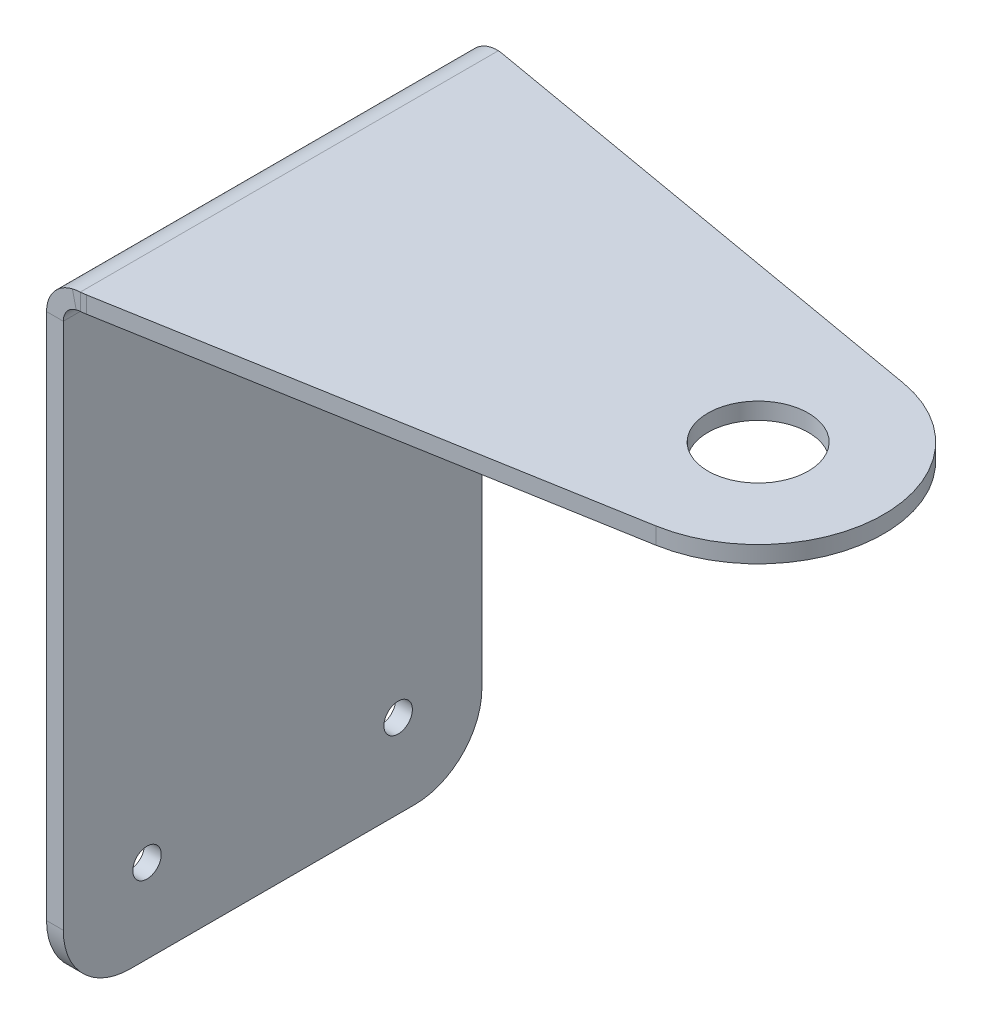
ISO-10303-21;
HEADER;
FILE_DESCRIPTION(('STEP AP214'),'2;1');
FILE_NAME('part.step','',(''),(''),'','','');
FILE_SCHEMA(('AUTOMOTIVE_DESIGN { 1 0 10303 214 1 1 1 1 }'));
ENDSEC;
DATA;
#1=APPLICATION_CONTEXT('core data for automotive mechanical design processes');
#2=APPLICATION_PROTOCOL_DEFINITION('international standard','automotive_design',2000,#1);
#3=PRODUCT_CONTEXT('',#1,'mechanical');
#4=PRODUCT('Part','Part','',(#3));
#5=PRODUCT_RELATED_PRODUCT_CATEGORY('part','',(#4));
#6=PRODUCT_DEFINITION_FORMATION('','',#4);
#7=PRODUCT_DEFINITION_CONTEXT('part definition',#1,'design');
#8=PRODUCT_DEFINITION('design','',#6,#7);
#9=PRODUCT_DEFINITION_SHAPE('','',#8);
#10=(LENGTH_UNIT() NAMED_UNIT(*) SI_UNIT(.MILLI.,.METRE.));
#11=(NAMED_UNIT(*) PLANE_ANGLE_UNIT() SI_UNIT($,.RADIAN.));
#12=(NAMED_UNIT(*) SI_UNIT($,.STERADIAN.) SOLID_ANGLE_UNIT());
#13=UNCERTAINTY_MEASURE_WITH_UNIT(LENGTH_MEASURE(1.E-05),#10,'distance_accuracy_value','');
#14=(GEOMETRIC_REPRESENTATION_CONTEXT(3) GLOBAL_UNCERTAINTY_ASSIGNED_CONTEXT((#13)) GLOBAL_UNIT_ASSIGNED_CONTEXT((#10,
#11,#12)) REPRESENTATION_CONTEXT('',''));
#15=CARTESIAN_POINT('',(0.,0.,0.));
#16=DIRECTION('',(0.,0.,1.));
#17=DIRECTION('',(1.,0.,0.));
#18=AXIS2_PLACEMENT_3D('',#15,#16,#17);
#19=CARTESIAN_POINT('',(0.,-2.,25.));
#20=DIRECTION('',(0.,1.,0.));
#21=DIRECTION('',(0.,0.,1.));
#22=AXIS2_PLACEMENT_3D('',#19,#20,#21);
#23=PLANE('',#22);
#24=CARTESIAN_POINT('',(60.,-2.,0.));
#25=DIRECTION('',(0.,1.,0.));
#26=DIRECTION('',(0.,0.,1.));
#27=AXIS2_PLACEMENT_3D('',#24,#25,#26);
#28=CIRCLE('',#27,6.);
#29=CARTESIAN_POINT('',(60.,-2.,6.));
#30=VERTEX_POINT('',#29);
#31=EDGE_CURVE('E535',#30,#30,#28,.T.);
#32=ORIENTED_EDGE('',*,*,#31,.T.);
#33=EDGE_LOOP('',(#32));
#34=FACE_BOUND('',#33,.T.);
#35=DIRECTION('',(0.,0.,-1.));
#36=VECTOR('',#35,1.);
#37=CARTESIAN_POINT('',(4.,-2.,25.));
#38=LINE('',#37,#36);
#39=CARTESIAN_POINT('',(4.,-2.,24.9699405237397));
#40=VERTEX_POINT('',#39);
#41=CARTESIAN_POINT('',(4.,-2.,-24.9699405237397));
#42=VERTEX_POINT('',#41);
#43=EDGE_CURVE('E61',#40,#42,#38,.T.);
#44=ORIENTED_EDGE('',*,*,#43,.T.);
#45=CARTESIAN_POINT('',(3.3071450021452,-2.,-17.));
#46=DIRECTION('',(0.,1.,0.));
#47=DIRECTION('',(-1.,0.,0.));
#48=AXIS2_PLACEMENT_3D('',#45,#46,#47);
#49=CIRCLE('',#48,8.);
#50=CARTESIAN_POINT('',(4.68253851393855,-2.,-24.8808814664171));
#51=VERTEX_POINT('',#50);
#52=EDGE_CURVE('E76',#42,#51,#49,.F.);
#53=ORIENTED_EDGE('',*,*,#52,.T.);
#54=DIRECTION('',(0.985110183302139,0.,0.171924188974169));
#55=VECTOR('',#54,1.);
#56=CARTESIAN_POINT('',(4.,-2.00000000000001,-25.));
#57=LINE('',#56,#55);
#58=CARTESIAN_POINT('',(62.5788628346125,-2.00000000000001,-14.7766527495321));
#59=VERTEX_POINT('',#58);
#60=EDGE_CURVE('E390',#51,#59,#57,.T.);
#61=ORIENTED_EDGE('',*,*,#60,.T.);
#62=CARTESIAN_POINT('',(60.,-2.00000000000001,0.));
#63=DIRECTION('',(0.,1.,0.));
#64=DIRECTION('',(0.,0.,1.));
#65=AXIS2_PLACEMENT_3D('',#62,#63,#64);
#66=CIRCLE('',#65,15.);
#67=CARTESIAN_POINT('',(62.5788628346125,-2.,14.7766527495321));
#68=VERTEX_POINT('',#67);
#69=EDGE_CURVE('E378',#59,#68,#66,.F.);
#70=ORIENTED_EDGE('',*,*,#69,.T.);
#71=DIRECTION('',(-0.985110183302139,0.,0.171924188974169));
#72=VECTOR('',#71,1.);
#73=CARTESIAN_POINT('',(62.5788628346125,-2.00000000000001,14.7766527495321));
#74=LINE('',#73,#72);
#75=CARTESIAN_POINT('',(4.68253851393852,-2.00000000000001,24.8808814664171));
#76=VERTEX_POINT('',#75);
#77=EDGE_CURVE('E376',#68,#76,#74,.T.);
#78=ORIENTED_EDGE('',*,*,#77,.T.);
#79=CARTESIAN_POINT('',(3.30714500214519,-2.,17.));
#80=DIRECTION('',(0.,1.,0.));
#81=DIRECTION('',(-1.,0.,0.));
#82=AXIS2_PLACEMENT_3D('',#79,#80,#81);
#83=CIRCLE('',#82,8.);
#84=EDGE_CURVE('E68',#76,#40,#83,.F.);
#85=ORIENTED_EDGE('',*,*,#84,.T.);
#86=EDGE_LOOP('',(#44,#53,#61,#70,#78,#85));
#87=FACE_BOUND('',#86,.T.);
#88=ADVANCED_FACE('F50',(#34,#87),#23,.F.);
#89=CARTESIAN_POINT('',(0.,0.,25.));
#90=DIRECTION('',(0.,1.,0.));
#91=DIRECTION('',(0.,0.,1.));
#92=AXIS2_PLACEMENT_3D('',#89,#90,#91);
#93=PLANE('',#92);
#94=CARTESIAN_POINT('',(60.,0.,0.));
#95=DIRECTION('',(0.,1.,0.));
#96=DIRECTION('',(0.,0.,1.));
#97=AXIS2_PLACEMENT_3D('',#94,#95,#96);
#98=CIRCLE('',#97,6.);
#99=CARTESIAN_POINT('',(60.,0.,6.));
#100=VERTEX_POINT('',#99);
#101=EDGE_CURVE('E532',#100,#100,#98,.T.);
#102=ORIENTED_EDGE('',*,*,#101,.F.);
#103=EDGE_LOOP('',(#102));
#104=FACE_BOUND('',#103,.T.);
#105=DIRECTION('',(0.985110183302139,0.,0.171924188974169));
#106=VECTOR('',#105,1.);
#107=CARTESIAN_POINT('',(4.,0.,-25.));
#108=LINE('',#107,#106);
#109=CARTESIAN_POINT('',(4.68253851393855,0.,-24.8808814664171));
#110=VERTEX_POINT('',#109);
#111=CARTESIAN_POINT('',(62.5788628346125,0.,-14.7766527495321));
#112=VERTEX_POINT('',#111);
#113=EDGE_CURVE('E170',#110,#112,#108,.T.);
#114=ORIENTED_EDGE('',*,*,#113,.F.);
#115=CARTESIAN_POINT('',(3.3071450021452,0.,-17.));
#116=DIRECTION('',(0.,1.,0.));
#117=DIRECTION('',(-1.,0.,0.));
#118=AXIS2_PLACEMENT_3D('',#115,#116,#117);
#119=CIRCLE('',#118,8.);
#120=CARTESIAN_POINT('',(4.,0.,-24.9699405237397));
#121=VERTEX_POINT('',#120);
#122=EDGE_CURVE('E155',#110,#121,#119,.T.);
#123=ORIENTED_EDGE('',*,*,#122,.T.);
#124=DIRECTION('',(0.,0.,-1.));
#125=VECTOR('',#124,1.);
#126=CARTESIAN_POINT('',(4.,0.,25.));
#127=LINE('',#126,#125);
#128=CARTESIAN_POINT('',(4.,0.,24.9699405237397));
#129=VERTEX_POINT('',#128);
#130=EDGE_CURVE('E162',#129,#121,#127,.T.);
#131=ORIENTED_EDGE('',*,*,#130,.F.);
#132=CARTESIAN_POINT('',(3.30714500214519,0.,17.));
#133=DIRECTION('',(0.,1.,0.));
#134=DIRECTION('',(-1.,0.,0.));
#135=AXIS2_PLACEMENT_3D('',#132,#133,#134);
#136=CIRCLE('',#135,8.);
#137=CARTESIAN_POINT('',(4.68253851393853,0.,24.8808814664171));
#138=VERTEX_POINT('',#137);
#139=EDGE_CURVE('E171',#129,#138,#136,.T.);
#140=ORIENTED_EDGE('',*,*,#139,.T.);
#141=DIRECTION('',(-0.985110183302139,0.,0.171924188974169));
#142=VECTOR('',#141,1.);
#143=CARTESIAN_POINT('',(62.5788628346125,0.,14.7766527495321));
#144=LINE('',#143,#142);
#145=CARTESIAN_POINT('',(62.5788628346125,0.,14.7766527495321));
#146=VERTEX_POINT('',#145);
#147=EDGE_CURVE('E371',#146,#138,#144,.T.);
#148=ORIENTED_EDGE('',*,*,#147,.F.);
#149=CARTESIAN_POINT('',(60.,0.,0.));
#150=DIRECTION('',(0.,1.,0.));
#151=DIRECTION('',(0.,0.,1.));
#152=AXIS2_PLACEMENT_3D('',#149,#150,#151);
#153=CIRCLE('',#152,15.);
#154=EDGE_CURVE('E388',#112,#146,#153,.F.);
#155=ORIENTED_EDGE('',*,*,#154,.F.);
#156=EDGE_LOOP('',(#114,#123,#131,#140,#148,#155));
#157=FACE_BOUND('',#156,.T.);
#158=ADVANCED_FACE('F167',(#104,#157),#93,.T.);
#159=CARTESIAN_POINT('',(4.,-2.00000000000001,-25.));
#160=DIRECTION('',(-0.171924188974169,0.,0.985110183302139));
#161=DIRECTION('',(0.985110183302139,0.,0.171924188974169));
#162=AXIS2_PLACEMENT_3D('',#159,#160,#161);
#163=PLANE('',#162);
#164=ORIENTED_EDGE('',*,*,#60,.F.);
#165=DIRECTION('',(0.,1.,0.));
#166=VECTOR('',#165,1.);
#167=CARTESIAN_POINT('',(4.68253851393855,-2.,-24.8808814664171));
#168=LINE('',#167,#166);
#169=EDGE_CURVE('E360',#51,#110,#168,.T.);
#170=ORIENTED_EDGE('',*,*,#169,.T.);
#171=ORIENTED_EDGE('',*,*,#113,.T.);
#172=DIRECTION('',(0.,-1.,0.));
#173=VECTOR('',#172,1.);
#174=CARTESIAN_POINT('',(62.5788628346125,-2.00000000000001,-14.7766527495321));
#175=LINE('',#174,#173);
#176=EDGE_CURVE('E387',#59,#112,#175,.F.);
#177=ORIENTED_EDGE('',*,*,#176,.F.);
#178=EDGE_LOOP('',(#164,#170,#171,#177));
#179=FACE_BOUND('',#178,.T.);
#180=ADVANCED_FACE('F397',(#179),#163,.F.);
#181=CARTESIAN_POINT('',(60.,-2.00000000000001,0.));
#182=DIRECTION('',(0.,1.,0.));
#183=DIRECTION('',(0.,0.,1.));
#184=AXIS2_PLACEMENT_3D('',#181,#182,#183);
#185=CYLINDRICAL_SURFACE('',#184,15.);
#186=ORIENTED_EDGE('',*,*,#69,.F.);
#187=ORIENTED_EDGE('',*,*,#176,.T.);
#188=ORIENTED_EDGE('',*,*,#154,.T.);
#189=DIRECTION('',(0.,-1.,0.));
#190=VECTOR('',#189,1.);
#191=CARTESIAN_POINT('',(62.5788628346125,-2.,14.7766527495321));
#192=LINE('',#191,#190);
#193=EDGE_CURVE('E375',#68,#146,#192,.F.);
#194=ORIENTED_EDGE('',*,*,#193,.F.);
#195=EDGE_LOOP('',(#186,#187,#188,#194));
#196=FACE_BOUND('',#195,.T.);
#197=ADVANCED_FACE('F398',(#196),#185,.T.);
#198=CARTESIAN_POINT('',(62.5788628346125,-2.00000000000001,14.7766527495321));
#199=DIRECTION('',(-0.171924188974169,0.,-0.985110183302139));
#200=DIRECTION('',(-0.985110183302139,0.,0.171924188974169));
#201=AXIS2_PLACEMENT_3D('',#198,#199,#200);
#202=PLANE('',#201);
#203=ORIENTED_EDGE('',*,*,#147,.T.);
#204=DIRECTION('',(0.,-1.,0.));
#205=VECTOR('',#204,1.);
#206=CARTESIAN_POINT('',(4.68253851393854,-2.00000000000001,24.8808814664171));
#207=LINE('',#206,#205);
#208=EDGE_CURVE('E185',#138,#76,#207,.T.);
#209=ORIENTED_EDGE('',*,*,#208,.T.);
#210=ORIENTED_EDGE('',*,*,#77,.F.);
#211=ORIENTED_EDGE('',*,*,#193,.T.);
#212=EDGE_LOOP('',(#203,#209,#210,#211));
#213=FACE_BOUND('',#212,.T.);
#214=ADVANCED_FACE('F373',(#213),#202,.F.);
#215=CARTESIAN_POINT('',(3.3071450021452,-2.,-17.));
#216=DIRECTION('',(0.,-1.,0.));
#217=DIRECTION('',(1.,0.,0.));
#218=AXIS2_PLACEMENT_3D('',#215,#216,#217);
#219=CYLINDRICAL_SURFACE('',#218,8.);
#220=CARTESIAN_POINT('',(4.,0.,-24.9699405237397));
#221=CARTESIAN_POINT('',(4.,-2.,-24.9699405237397));
#222=B_SPLINE_CURVE_WITH_KNOTS('',1,(#220,#221),.UNSPECIFIED.,.F.,.F.,(2,2),(0.,1.),.UNSPECIFIED.);
#223=EDGE_CURVE('E152',#121,#42,#222,.T.);
#224=ORIENTED_EDGE('',*,*,#223,.F.);
#225=ORIENTED_EDGE('',*,*,#122,.F.);
#226=ORIENTED_EDGE('',*,*,#169,.F.);
#227=ORIENTED_EDGE('',*,*,#52,.F.);
#228=EDGE_LOOP('',(#224,#225,#226,#227));
#229=FACE_BOUND('',#228,.T.);
#230=ADVANCED_FACE('F154',(#229),#219,.T.);
#231=CARTESIAN_POINT('',(3.30714500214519,-2.00000000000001,17.));
#232=DIRECTION('',(0.,1.,0.));
#233=DIRECTION('',(-1.,0.,0.));
#234=AXIS2_PLACEMENT_3D('',#231,#232,#233);
#235=CYLINDRICAL_SURFACE('',#234,8.);
#236=CARTESIAN_POINT('',(4.,-2.,24.9699405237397));
#237=CARTESIAN_POINT('',(4.,0.,24.9699405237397));
#238=B_SPLINE_CURVE_WITH_KNOTS('',1,(#236,#237),.UNSPECIFIED.,.F.,.F.,(2,2),(0.,1.),.UNSPECIFIED.);
#239=EDGE_CURVE('E12',#40,#129,#238,.T.);
#240=ORIENTED_EDGE('',*,*,#239,.F.);
#241=ORIENTED_EDGE('',*,*,#84,.F.);
#242=ORIENTED_EDGE('',*,*,#208,.F.);
#243=ORIENTED_EDGE('',*,*,#139,.F.);
#244=EDGE_LOOP('',(#240,#241,#242,#243));
#245=FACE_BOUND('',#244,.T.);
#246=ADVANCED_FACE('F52',(#245),#235,.T.);
#247=CARTESIAN_POINT('',(4.,-67.,-17.));
#248=DIRECTION('',(-1.,0.,0.));
#249=DIRECTION('',(0.,0.,1.));
#250=AXIS2_PLACEMENT_3D('',#247,#248,#249);
#251=CYLINDRICAL_SURFACE('',#250,8.);
#252=CARTESIAN_POINT('',(2.,-67.,-17.));
#253=DIRECTION('',(-1.,0.,0.));
#254=DIRECTION('',(0.,0.,1.));
#255=AXIS2_PLACEMENT_3D('',#252,#253,#254);
#256=CIRCLE('',#255,8.);
#257=CARTESIAN_POINT('',(2.,-75.,-17.));
#258=VERTEX_POINT('',#257);
#259=CARTESIAN_POINT('',(2.,-67.,-25.));
#260=VERTEX_POINT('',#259);
#261=EDGE_CURVE('E475',#258,#260,#256,.F.);
#262=ORIENTED_EDGE('',*,*,#261,.F.);
#263=DIRECTION('',(-1.,0.,0.));
#264=VECTOR('',#263,1.);
#265=CARTESIAN_POINT('',(2.,-75.,-17.));
#266=LINE('',#265,#264);
#267=CARTESIAN_POINT('',(0.,-75.,-17.));
#268=VERTEX_POINT('',#267);
#269=EDGE_CURVE('E497',#268,#258,#266,.F.);
#270=ORIENTED_EDGE('',*,*,#269,.F.);
#271=CARTESIAN_POINT('',(0.,-67.,-17.));
#272=DIRECTION('',(-1.,0.,0.));
#273=DIRECTION('',(0.,0.,1.));
#274=AXIS2_PLACEMENT_3D('',#271,#272,#273);
#275=CIRCLE('',#274,8.);
#276=CARTESIAN_POINT('',(0.,-67.,-25.));
#277=VERTEX_POINT('',#276);
#278=EDGE_CURVE('E493',#277,#268,#275,.T.);
#279=ORIENTED_EDGE('',*,*,#278,.F.);
#280=DIRECTION('',(-1.,0.,0.));
#281=VECTOR('',#280,1.);
#282=CARTESIAN_POINT('',(4.,-67.,-25.));
#283=LINE('',#282,#281);
#284=EDGE_CURVE('E490',#260,#277,#283,.T.);
#285=ORIENTED_EDGE('',*,*,#284,.F.);
#286=EDGE_LOOP('',(#262,#270,#279,#285));
#287=FACE_BOUND('',#286,.T.);
#288=ADVANCED_FACE('F421',(#287),#251,.T.);
#289=CARTESIAN_POINT('',(2.,-67.,17.));
#290=DIRECTION('',(-1.,0.,0.));
#291=DIRECTION('',(0.,0.,1.));
#292=AXIS2_PLACEMENT_3D('',#289,#290,#291);
#293=CYLINDRICAL_SURFACE('',#292,8.);
#294=CARTESIAN_POINT('',(2.,-67.,17.));
#295=DIRECTION('',(-1.,0.,0.));
#296=DIRECTION('',(0.,0.,1.));
#297=AXIS2_PLACEMENT_3D('',#294,#295,#296);
#298=CIRCLE('',#297,8.);
#299=CARTESIAN_POINT('',(2.,-67.,25.));
#300=VERTEX_POINT('',#299);
#301=CARTESIAN_POINT('',(2.,-75.,17.));
#302=VERTEX_POINT('',#301);
#303=EDGE_CURVE('E469',#300,#302,#298,.F.);
#304=ORIENTED_EDGE('',*,*,#303,.F.);
#305=DIRECTION('',(-1.,0.,0.));
#306=VECTOR('',#305,1.);
#307=CARTESIAN_POINT('',(4.,-67.,25.));
#308=LINE('',#307,#306);
#309=CARTESIAN_POINT('',(0.,-67.,25.));
#310=VERTEX_POINT('',#309);
#311=EDGE_CURVE('E459',#310,#300,#308,.F.);
#312=ORIENTED_EDGE('',*,*,#311,.F.);
#313=CARTESIAN_POINT('',(0.,-67.,17.));
#314=DIRECTION('',(-1.,0.,0.));
#315=DIRECTION('',(0.,0.,1.));
#316=AXIS2_PLACEMENT_3D('',#313,#314,#315);
#317=CIRCLE('',#316,8.);
#318=CARTESIAN_POINT('',(0.,-75.,17.));
#319=VERTEX_POINT('',#318);
#320=EDGE_CURVE('E464',#319,#310,#317,.T.);
#321=ORIENTED_EDGE('',*,*,#320,.F.);
#322=DIRECTION('',(-1.,0.,0.));
#323=VECTOR('',#322,1.);
#324=CARTESIAN_POINT('',(2.,-75.,17.));
#325=LINE('',#324,#323);
#326=EDGE_CURVE('E501',#302,#319,#325,.T.);
#327=ORIENTED_EDGE('',*,*,#326,.F.);
#328=EDGE_LOOP('',(#304,#312,#321,#327));
#329=FACE_BOUND('',#328,.T.);
#330=ADVANCED_FACE('F425',(#329),#293,.T.);
#331=CARTESIAN_POINT('',(2.,-75.,25.));
#332=DIRECTION('',(0.,-1.,0.));
#333=DIRECTION('',(0.,0.,-1.));
#334=AXIS2_PLACEMENT_3D('',#331,#332,#333);
#335=PLANE('',#334);
#336=DIRECTION('',(0.,0.,-1.));
#337=VECTOR('',#336,1.);
#338=CARTESIAN_POINT('',(2.,-75.,25.));
#339=LINE('',#338,#337);
#340=EDGE_CURVE('E480',#302,#258,#339,.T.);
#341=ORIENTED_EDGE('',*,*,#340,.F.);
#342=ORIENTED_EDGE('',*,*,#326,.T.);
#343=DIRECTION('',(0.,0.,-1.));
#344=VECTOR('',#343,1.);
#345=CARTESIAN_POINT('',(0.,-75.,25.));
#346=LINE('',#345,#344);
#347=EDGE_CURVE('E499',#319,#268,#346,.T.);
#348=ORIENTED_EDGE('',*,*,#347,.T.);
#349=ORIENTED_EDGE('',*,*,#269,.T.);
#350=EDGE_LOOP('',(#341,#342,#348,#349));
#351=FACE_BOUND('',#350,.T.);
#352=ADVANCED_FACE('F430',(#351),#335,.T.);
#353=CARTESIAN_POINT('',(0.,-75.,25.));
#354=DIRECTION('',(-1.,0.,0.));
#355=DIRECTION('',(0.,0.,1.));
#356=AXIS2_PLACEMENT_3D('',#353,#354,#355);
#357=PLANE('',#356);
#358=CARTESIAN_POINT('',(0.,-65.,15.));
#359=DIRECTION('',(-1.,0.,0.));
#360=DIRECTION('',(0.,0.,1.));
#361=AXIS2_PLACEMENT_3D('',#358,#359,#360);
#362=CIRCLE('',#361,1.69999999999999);
#363=CARTESIAN_POINT('',(0.,-65.,16.7));
#364=VERTEX_POINT('',#363);
#365=EDGE_CURVE('E543',#364,#364,#362,.T.);
#366=ORIENTED_EDGE('',*,*,#365,.F.);
#367=EDGE_LOOP('',(#366));
#368=FACE_BOUND('',#367,.T.);
#369=CARTESIAN_POINT('',(0.,-65.,-15.));
#370=DIRECTION('',(-1.,0.,0.));
#371=DIRECTION('',(0.,0.,1.));
#372=AXIS2_PLACEMENT_3D('',#369,#370,#371);
#373=CIRCLE('',#372,1.69999999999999);
#374=CARTESIAN_POINT('',(0.,-65.,-13.3));
#375=VERTEX_POINT('',#374);
#376=EDGE_CURVE('E536',#375,#375,#373,.T.);
#377=ORIENTED_EDGE('',*,*,#376,.F.);
#378=EDGE_LOOP('',(#377));
#379=FACE_BOUND('',#378,.T.);
#380=ORIENTED_EDGE('',*,*,#347,.F.);
#381=ORIENTED_EDGE('',*,*,#320,.T.);
#382=DIRECTION('',(0.,1.,0.));
#383=VECTOR('',#382,1.);
#384=CARTESIAN_POINT('',(0.,-75.,25.));
#385=LINE('',#384,#383);
#386=CARTESIAN_POINT('',(0.,-4.,25.));
#387=VERTEX_POINT('',#386);
#388=EDGE_CURVE('E457',#310,#387,#385,.T.);
#389=ORIENTED_EDGE('',*,*,#388,.T.);
#390=DIRECTION('',(0.,0.,-1.));
#391=VECTOR('',#390,1.);
#392=CARTESIAN_POINT('',(0.,-4.,25.));
#393=LINE('',#392,#391);
#394=CARTESIAN_POINT('',(0.,-4.,-25.));
#395=VERTEX_POINT('',#394);
#396=EDGE_CURVE('E463',#387,#395,#393,.T.);
#397=ORIENTED_EDGE('',*,*,#396,.T.);
#398=DIRECTION('',(0.,1.,0.));
#399=VECTOR('',#398,1.);
#400=CARTESIAN_POINT('',(0.,-75.,-25.));
#401=LINE('',#400,#399);
#402=EDGE_CURVE('E487',#277,#395,#401,.T.);
#403=ORIENTED_EDGE('',*,*,#402,.F.);
#404=ORIENTED_EDGE('',*,*,#278,.T.);
#405=EDGE_LOOP('',(#380,#381,#389,#397,#403,#404));
#406=FACE_BOUND('',#405,.T.);
#407=ADVANCED_FACE('F437',(#368,#379,#406),#357,.T.);
#408=CARTESIAN_POINT('',(4.,-2.,-25.));
#409=DIRECTION('',(0.,0.,-1.));
#410=DIRECTION('',(-1.,0.,0.));
#411=AXIS2_PLACEMENT_3D('',#408,#409,#410);
#412=PLANE('',#411);
#413=DIRECTION('',(0.,1.,0.));
#414=VECTOR('',#413,1.);
#415=CARTESIAN_POINT('',(2.,-75.,-25.));
#416=LINE('',#415,#414);
#417=CARTESIAN_POINT('',(2.,-4.,-25.));
#418=VERTEX_POINT('',#417);
#419=EDGE_CURVE('E471',#260,#418,#416,.T.);
#420=ORIENTED_EDGE('',*,*,#419,.F.);
#421=ORIENTED_EDGE('',*,*,#284,.T.);
#422=ORIENTED_EDGE('',*,*,#402,.T.);
#423=DIRECTION('',(1.,0.,0.));
#424=VECTOR('',#423,1.);
#425=CARTESIAN_POINT('',(0.,-4.,-25.));
#426=LINE('',#425,#424);
#427=EDGE_CURVE('E484',#395,#418,#426,.T.);
#428=ORIENTED_EDGE('',*,*,#427,.T.);
#429=EDGE_LOOP('',(#420,#421,#422,#428));
#430=FACE_BOUND('',#429,.T.);
#431=ADVANCED_FACE('F441',(#430),#412,.T.);
#432=CARTESIAN_POINT('',(2.,-75.,25.));
#433=DIRECTION('',(-1.,0.,0.));
#434=DIRECTION('',(0.,0.,1.));
#435=AXIS2_PLACEMENT_3D('',#432,#433,#434);
#436=PLANE('',#435);
#437=CARTESIAN_POINT('',(2.,-65.,15.));
#438=DIRECTION('',(1.,0.,0.));
#439=DIRECTION('',(0.,0.,-1.));
#440=AXIS2_PLACEMENT_3D('',#437,#438,#439);
#441=CIRCLE('',#440,1.69999999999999);
#442=CARTESIAN_POINT('',(2.,-65.,13.3));
#443=VERTEX_POINT('',#442);
#444=EDGE_CURVE('E546',#443,#443,#441,.T.);
#445=ORIENTED_EDGE('',*,*,#444,.F.);
#446=EDGE_LOOP('',(#445));
#447=FACE_BOUND('',#446,.T.);
#448=CARTESIAN_POINT('',(2.,-65.,-15.));
#449=DIRECTION('',(1.,0.,0.));
#450=DIRECTION('',(0.,0.,-1.));
#451=AXIS2_PLACEMENT_3D('',#448,#449,#450);
#452=CIRCLE('',#451,1.69999999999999);
#453=CARTESIAN_POINT('',(2.,-65.,-16.7));
#454=VERTEX_POINT('',#453);
#455=EDGE_CURVE('E540',#454,#454,#452,.T.);
#456=ORIENTED_EDGE('',*,*,#455,.F.);
#457=EDGE_LOOP('',(#456));
#458=FACE_BOUND('',#457,.T.);
#459=DIRECTION('',(0.,1.,0.));
#460=VECTOR('',#459,1.);
#461=CARTESIAN_POINT('',(2.,-75.,25.));
#462=LINE('',#461,#460);
#463=CARTESIAN_POINT('',(2.,-4.,25.));
#464=VERTEX_POINT('',#463);
#465=EDGE_CURVE('E470',#300,#464,#462,.T.);
#466=ORIENTED_EDGE('',*,*,#465,.F.);
#467=ORIENTED_EDGE('',*,*,#303,.T.);
#468=ORIENTED_EDGE('',*,*,#340,.T.);
#469=ORIENTED_EDGE('',*,*,#261,.T.);
#470=ORIENTED_EDGE('',*,*,#419,.T.);
#471=DIRECTION('',(0.,0.,-1.));
#472=VECTOR('',#471,1.);
#473=CARTESIAN_POINT('',(2.,-4.,25.));
#474=LINE('',#473,#472);
#475=EDGE_CURVE('E383',#464,#418,#474,.T.);
#476=ORIENTED_EDGE('',*,*,#475,.F.);
#477=EDGE_LOOP('',(#466,#467,#468,#469,#470,#476));
#478=FACE_BOUND('',#477,.T.);
#479=ADVANCED_FACE('F445',(#447,#458,#478),#436,.F.);
#480=CARTESIAN_POINT('',(4.,-4.,25.));
#481=DIRECTION('',(0.,0.,1.));
#482=DIRECTION('',(1.,0.,0.));
#483=AXIS2_PLACEMENT_3D('',#480,#481,#482);
#484=PLANE('',#483);
#485=ORIENTED_EDGE('',*,*,#388,.F.);
#486=ORIENTED_EDGE('',*,*,#311,.T.);
#487=ORIENTED_EDGE('',*,*,#465,.T.);
#488=DIRECTION('',(-1.,0.,0.));
#489=VECTOR('',#488,1.);
#490=CARTESIAN_POINT('',(2.,-4.,25.));
#491=LINE('',#490,#489);
#492=EDGE_CURVE('E380',#464,#387,#491,.T.);
#493=ORIENTED_EDGE('',*,*,#492,.T.);
#494=EDGE_LOOP('',(#485,#486,#487,#493));
#495=FACE_BOUND('',#494,.T.);
#496=ADVANCED_FACE('F217',(#495),#484,.T.);
#497=CARTESIAN_POINT('',(4.,0.,-24.9699405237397));
#498=CARTESIAN_POINT('',(3.69203962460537,0.,-24.9799611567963));
#499=CARTESIAN_POINT('',(3.38416761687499,-0.0357106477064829,-24.9899793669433));
#500=CARTESIAN_POINT('',(3.08438389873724,-0.106204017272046,-25.));
#501=CARTESIAN_POINT('',(4.,-2.,-24.9699405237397));
#502=CARTESIAN_POINT('',(3.84601984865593,-2.,-24.9799611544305));
#503=CARTESIAN_POINT('',(3.69208377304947,-2.01785533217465,-24.9899793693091));
#504=CARTESIAN_POINT('',(3.54219194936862,-2.05310200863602,-25.));
#505=B_SPLINE_SURFACE_WITH_KNOTS('',1,3,((#497,#498,#499,#500),(#501,#502,#503,#504)),
.UNSPECIFIED.,.F.,.F.,.F.,(2,2),(4,4),(0.,1.),(0.,1.),.UNSPECIFIED.);
#506=CARTESIAN_POINT('',(4.,-2.,-24.9699405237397));
#507=CARTESIAN_POINT('',(3.84601984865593,-2.,-24.9799611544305));
#508=CARTESIAN_POINT('',(3.69208377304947,-2.01785533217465,-24.9899793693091));
#509=CARTESIAN_POINT('',(3.54219194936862,-2.05310200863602,-25.));
#510=B_SPLINE_CURVE_WITH_KNOTS('',3,(#506,#507,#508,#509),.UNSPECIFIED.,.F.,.F.,(4,4),(0.,1.),.UNSPECIFIED.);
#511=CARTESIAN_POINT('',(3.54219194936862,-2.05310200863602,-25.));
#512=VERTEX_POINT('',#511);
#513=EDGE_CURVE('E339',#42,#512,#510,.T.);
#514=CARTESIAN_POINT('',(3.54219194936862,-2.05310200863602,-25.));
#515=CARTESIAN_POINT('',(3.08438389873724,-0.106204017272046,-25.));
#516=B_SPLINE_CURVE_WITH_KNOTS('',1,(#514,#515),.UNSPECIFIED.,.F.,.F.,(2,2),(0.,1.),.UNSPECIFIED.);
#517=CARTESIAN_POINT('',(3.08438389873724,-0.106204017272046,-25.));
#518=VERTEX_POINT('',#517);
#519=EDGE_CURVE('E189',#512,#518,#516,.T.);
#520=CARTESIAN_POINT('',(3.08438389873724,-0.106204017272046,-25.));
#521=CARTESIAN_POINT('',(3.38416761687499,-0.0357106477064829,-24.9899793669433));
#522=CARTESIAN_POINT('',(3.69203962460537,0.,-24.9799611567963));
#523=CARTESIAN_POINT('',(4.,0.,-24.9699405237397));
#524=B_SPLINE_CURVE_WITH_KNOTS('',3,(#520,#521,#522,#523),.UNSPECIFIED.,.F.,.F.,(4,4),(0.,1.),.UNSPECIFIED.);
#525=EDGE_CURVE('E179',#121,#518,#524,.F.);
#526=ORIENTED_EDGE('',*,*,#223,.T.);
#527=ORIENTED_EDGE('',*,*,#513,.T.);
#528=ORIENTED_EDGE('',*,*,#519,.T.);
#529=ORIENTED_EDGE('',*,*,#525,.F.);
#530=EDGE_LOOP('',(#526,#527,#528,#529));
#531=FACE_BOUND('',#530,.T.);
#532=ADVANCED_FACE('F188',(#531),#505,.T.);
#533=CARTESIAN_POINT('',(4.,-4.,-25.));
#534=DIRECTION('',(0.,0.,-1.));
#535=DIRECTION('',(-1.,0.,0.));
#536=AXIS2_PLACEMENT_3D('',#533,#534,#535);
#537=PLANE('',#536);
#538=ORIENTED_EDGE('',*,*,#519,.F.);
#539=CARTESIAN_POINT('',(4.,-4.,-25.));
#540=DIRECTION('',(0.,0.,-1.));
#541=DIRECTION('',(-1.,0.,0.));
#542=AXIS2_PLACEMENT_3D('',#539,#540,#541);
#543=CIRCLE('',#542,2.);
#544=EDGE_CURVE('E316',#512,#418,#543,.F.);
#545=ORIENTED_EDGE('',*,*,#544,.T.);
#546=ORIENTED_EDGE('',*,*,#427,.F.);
#547=CARTESIAN_POINT('',(4.,-4.,-25.));
#548=DIRECTION('',(0.,0.,1.));
#549=DIRECTION('',(1.,0.,0.));
#550=AXIS2_PLACEMENT_3D('',#547,#548,#549);
#551=CIRCLE('',#550,4.);
#552=EDGE_CURVE('E192',#518,#395,#551,.T.);
#553=ORIENTED_EDGE('',*,*,#552,.F.);
#554=EDGE_LOOP('',(#538,#545,#546,#553));
#555=FACE_BOUND('',#554,.T.);
#556=ADVANCED_FACE('F216',(#555),#537,.T.);
#557=CARTESIAN_POINT('',(4.,-4.,25.));
#558=DIRECTION('',(0.,0.,1.));
#559=DIRECTION('',(1.,0.,0.));
#560=AXIS2_PLACEMENT_3D('',#557,#558,#559);
#561=PLANE('',#560);
#562=ORIENTED_EDGE('',*,*,#492,.F.);
#563=CARTESIAN_POINT('',(4.,-4.,25.));
#564=DIRECTION('',(0.,0.,-1.));
#565=DIRECTION('',(-1.,0.,0.));
#566=AXIS2_PLACEMENT_3D('',#563,#564,#565);
#567=CIRCLE('',#566,2.);
#568=CARTESIAN_POINT('',(3.54219194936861,-2.05310200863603,25.));
#569=VERTEX_POINT('',#568);
#570=EDGE_CURVE('E309',#464,#569,#567,.T.);
#571=ORIENTED_EDGE('',*,*,#570,.T.);
#572=CARTESIAN_POINT('',(3.08438389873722,-0.106204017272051,25.));
#573=CARTESIAN_POINT('',(3.54219194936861,-2.05310200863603,25.));
#574=B_SPLINE_CURVE_WITH_KNOTS('',1,(#572,#573),.UNSPECIFIED.,.F.,.F.,(2,2),(0.,1.),.UNSPECIFIED.);
#575=CARTESIAN_POINT('',(3.08438389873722,-0.106204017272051,25.));
#576=VERTEX_POINT('',#575);
#577=EDGE_CURVE('E280',#569,#576,#574,.F.);
#578=ORIENTED_EDGE('',*,*,#577,.T.);
#579=CARTESIAN_POINT('',(4.,-4.,25.));
#580=DIRECTION('',(0.,0.,-1.));
#581=DIRECTION('',(-1.,0.,0.));
#582=AXIS2_PLACEMENT_3D('',#579,#580,#581);
#583=CIRCLE('',#582,4.);
#584=EDGE_CURVE('E506',#387,#576,#583,.T.);
#585=ORIENTED_EDGE('',*,*,#584,.F.);
#586=EDGE_LOOP('',(#562,#571,#578,#585));
#587=FACE_BOUND('',#586,.T.);
#588=ADVANCED_FACE('F285',(#587),#561,.T.);
#589=CARTESIAN_POINT('',(3.08438389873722,-0.106204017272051,25.));
#590=CARTESIAN_POINT('',(3.38416761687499,-0.0357106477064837,24.9899793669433));
#591=CARTESIAN_POINT('',(3.69203962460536,0.,24.9799611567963));
#592=CARTESIAN_POINT('',(4.,0.,24.9699405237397));
#593=CARTESIAN_POINT('',(3.54219194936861,-2.05310200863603,25.));
#594=CARTESIAN_POINT('',(3.69208377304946,-2.01785533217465,24.9899793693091));
#595=CARTESIAN_POINT('',(3.84601984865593,-2.,24.9799611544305));
#596=CARTESIAN_POINT('',(4.,-2.,24.9699405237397));
#597=B_SPLINE_SURFACE_WITH_KNOTS('',1,3,((#589,#590,#591,#592),(#593,#594,#595,#596)),
.UNSPECIFIED.,.F.,.F.,.F.,(2,2),(4,4),(0.,1.),(0.,1.),.UNSPECIFIED.);
#598=CARTESIAN_POINT('',(3.54219194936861,-2.05310200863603,25.));
#599=CARTESIAN_POINT('',(3.69208377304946,-2.01785533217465,24.9899793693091));
#600=CARTESIAN_POINT('',(3.84601984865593,-2.,24.9799611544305));
#601=CARTESIAN_POINT('',(4.,-2.,24.9699405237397));
#602=B_SPLINE_CURVE_WITH_KNOTS('',3,(#598,#599,#600,#601),.UNSPECIFIED.,.F.,.F.,(4,4),(0.,1.),.UNSPECIFIED.);
#603=EDGE_CURVE('E193',#569,#40,#602,.T.);
#604=CARTESIAN_POINT('',(4.,0.,24.9699405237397));
#605=CARTESIAN_POINT('',(3.69203962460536,0.,24.9799611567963));
#606=CARTESIAN_POINT('',(3.38416761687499,-0.0357106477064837,24.9899793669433));
#607=CARTESIAN_POINT('',(3.08438389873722,-0.106204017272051,25.));
#608=B_SPLINE_CURVE_WITH_KNOTS('',3,(#604,#605,#606,#607),.UNSPECIFIED.,.F.,.F.,(4,4),(0.,1.),.UNSPECIFIED.);
#609=EDGE_CURVE('E183',#576,#129,#608,.F.);
#610=ORIENTED_EDGE('',*,*,#603,.T.);
#611=ORIENTED_EDGE('',*,*,#239,.T.);
#612=ORIENTED_EDGE('',*,*,#609,.F.);
#613=ORIENTED_EDGE('',*,*,#577,.F.);
#614=EDGE_LOOP('',(#610,#611,#612,#613));
#615=FACE_BOUND('',#614,.T.);
#616=ADVANCED_FACE('F220',(#615),#597,.T.);
#617=CARTESIAN_POINT('',(4.,-4.,50.2613828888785));
#618=DIRECTION('',(0.,0.,-1.));
#619=DIRECTION('',(-1.,0.,0.));
#620=AXIS2_PLACEMENT_3D('',#617,#618,#619);
#621=CYLINDRICAL_SURFACE('',#620,4.);
#622=ORIENTED_EDGE('',*,*,#584,.T.);
#623=ORIENTED_EDGE('',*,*,#609,.T.);
#624=ORIENTED_EDGE('',*,*,#130,.T.);
#625=ORIENTED_EDGE('',*,*,#525,.T.);
#626=ORIENTED_EDGE('',*,*,#552,.T.);
#627=ORIENTED_EDGE('',*,*,#396,.F.);
#628=EDGE_LOOP('',(#622,#623,#624,#625,#626,#627));
#629=FACE_BOUND('',#628,.T.);
#630=ADVANCED_FACE('F177',(#629),#621,.T.);
#631=CARTESIAN_POINT('',(4.,-4.,50.2613828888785));
#632=DIRECTION('',(0.,0.,-1.));
#633=DIRECTION('',(-1.,0.,0.));
#634=AXIS2_PLACEMENT_3D('',#631,#632,#633);
#635=CYLINDRICAL_SURFACE('',#634,2.);
#636=ORIENTED_EDGE('',*,*,#570,.F.);
#637=ORIENTED_EDGE('',*,*,#475,.T.);
#638=ORIENTED_EDGE('',*,*,#544,.F.);
#639=ORIENTED_EDGE('',*,*,#513,.F.);
#640=ORIENTED_EDGE('',*,*,#43,.F.);
#641=ORIENTED_EDGE('',*,*,#603,.F.);
#642=EDGE_LOOP('',(#636,#637,#638,#639,#640,#641));
#643=FACE_BOUND('',#642,.T.);
#644=ADVANCED_FACE('F293',(#643),#635,.F.);
#645=CARTESIAN_POINT('',(60.,-2.,0.));
#646=DIRECTION('',(0.,1.,0.));
#647=DIRECTION('',(0.,0.,1.));
#648=AXIS2_PLACEMENT_3D('',#645,#646,#647);
#649=CYLINDRICAL_SURFACE('',#648,6.);
#650=ORIENTED_EDGE('',*,*,#31,.F.);
#651=EDGE_LOOP('',(#650));
#652=FACE_BOUND('',#651,.T.);
#653=ORIENTED_EDGE('',*,*,#101,.T.);
#654=EDGE_LOOP('',(#653));
#655=FACE_BOUND('',#654,.T.);
#656=ADVANCED_FACE('F297',(#652,#655),#649,.F.);
#657=CARTESIAN_POINT('',(2.,-65.,-15.));
#658=DIRECTION('',(1.,0.,0.));
#659=DIRECTION('',(0.,0.,-1.));
#660=AXIS2_PLACEMENT_3D('',#657,#658,#659);
#661=CYLINDRICAL_SURFACE('',#660,1.69999999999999);
#662=ORIENTED_EDGE('',*,*,#455,.T.);
#663=EDGE_LOOP('',(#662));
#664=FACE_BOUND('',#663,.T.);
#665=ORIENTED_EDGE('',*,*,#376,.T.);
#666=EDGE_LOOP('',(#665));
#667=FACE_BOUND('',#666,.T.);
#668=ADVANCED_FACE('F587',(#664,#667),#661,.F.);
#669=CARTESIAN_POINT('',(2.,-65.,15.));
#670=DIRECTION('',(1.,0.,0.));
#671=DIRECTION('',(0.,0.,-1.));
#672=AXIS2_PLACEMENT_3D('',#669,#670,#671);
#673=CYLINDRICAL_SURFACE('',#672,1.69999999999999);
#674=ORIENTED_EDGE('',*,*,#444,.T.);
#675=EDGE_LOOP('',(#674));
#676=FACE_BOUND('',#675,.T.);
#677=ORIENTED_EDGE('',*,*,#365,.T.);
#678=EDGE_LOOP('',(#677));
#679=FACE_BOUND('',#678,.T.);
#680=ADVANCED_FACE('F550',(#676,#679),#673,.F.);
#681=CLOSED_SHELL('',(#88,#158,#180,#197,#214,#230,#246,#288,#330,#352,#407,#431,#479,#496,#532,
#556,#588,#616,#630,#644,#656,#668,#680));
#682=MANIFOLD_SOLID_BREP('B2',#681);
#683=ADVANCED_BREP_SHAPE_REPRESENTATION('',(#18,#682),#14);
#684=SHAPE_DEFINITION_REPRESENTATION(#9,#683);
ENDSEC;
END-ISO-10303-21;
